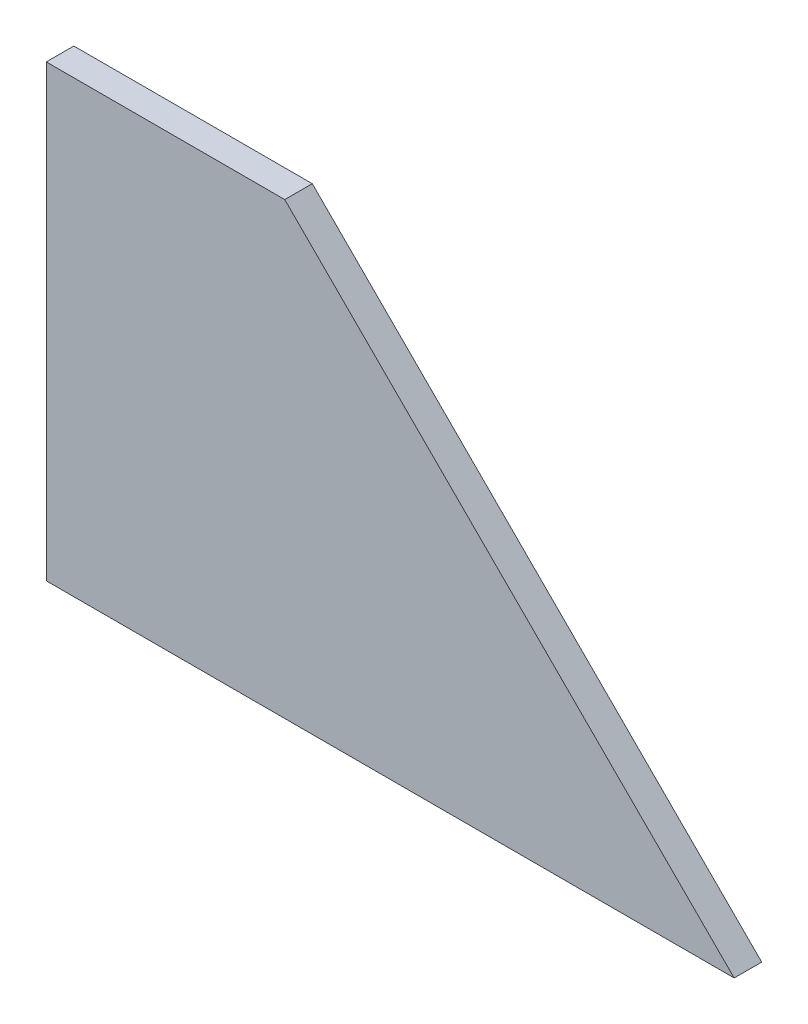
ISO-10303-21;
HEADER;
FILE_DESCRIPTION(('STEP AP214'),'2;1');
FILE_NAME('part.step','',(''),(''),'','','');
FILE_SCHEMA(('AUTOMOTIVE_DESIGN { 1 0 10303 214 1 1 1 1 }'));
ENDSEC;
DATA;
#1=APPLICATION_CONTEXT('core data for automotive mechanical design processes');
#2=APPLICATION_PROTOCOL_DEFINITION('international standard','automotive_design',2000,#1);
#3=PRODUCT_CONTEXT('',#1,'mechanical');
#4=PRODUCT('Part','Part','',(#3));
#5=PRODUCT_RELATED_PRODUCT_CATEGORY('part','',(#4));
#6=PRODUCT_DEFINITION_FORMATION('','',#4);
#7=PRODUCT_DEFINITION_CONTEXT('part definition',#1,'design');
#8=PRODUCT_DEFINITION('design','',#6,#7);
#9=PRODUCT_DEFINITION_SHAPE('','',#8);
#10=(LENGTH_UNIT() NAMED_UNIT(*) SI_UNIT(.MILLI.,.METRE.));
#11=(NAMED_UNIT(*) PLANE_ANGLE_UNIT() SI_UNIT($,.RADIAN.));
#12=(NAMED_UNIT(*) SI_UNIT($,.STERADIAN.) SOLID_ANGLE_UNIT());
#13=UNCERTAINTY_MEASURE_WITH_UNIT(LENGTH_MEASURE(1.E-05),#10,'distance_accuracy_value','');
#14=(GEOMETRIC_REPRESENTATION_CONTEXT(3) GLOBAL_UNCERTAINTY_ASSIGNED_CONTEXT((#13)) GLOBAL_UNIT_ASSIGNED_CONTEXT((#10,
#11,#12)) REPRESENTATION_CONTEXT('',''));
#15=CARTESIAN_POINT('',(0.,0.,0.));
#16=DIRECTION('',(0.,0.,1.));
#17=DIRECTION('',(1.,0.,0.));
#18=AXIS2_PLACEMENT_3D('',#15,#16,#17);
#19=CARTESIAN_POINT('',(0.,98.,-25.));
#20=DIRECTION('',(0.,-1.,0.));
#21=DIRECTION('',(0.,0.,-1.));
#22=AXIS2_PLACEMENT_3D('',#19,#20,#21);
#23=PLANE('',#22);
#24=DIRECTION('',(1.,0.,0.));
#25=VECTOR('',#24,1.);
#26=CARTESIAN_POINT('',(26.516504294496,98.,6.));
#27=LINE('',#26,#25);
#28=CARTESIAN_POINT('',(0.,98.,6.));
#29=VERTEX_POINT('',#28);
#30=CARTESIAN_POINT('',(52.,98.,6.));
#31=VERTEX_POINT('',#30);
#32=EDGE_CURVE('E10',#29,#31,#27,.T.);
#33=ORIENTED_EDGE('',*,*,#32,.T.);
#34=DIRECTION('',(0.,0.,1.));
#35=VECTOR('',#34,1.);
#36=CARTESIAN_POINT('',(52.,98.,-12.5));
#37=LINE('',#36,#35);
#38=CARTESIAN_POINT('',(52.,98.,0.));
#39=VERTEX_POINT('',#38);
#40=EDGE_CURVE('E78',#39,#31,#37,.T.);
#41=ORIENTED_EDGE('',*,*,#40,.F.);
#42=DIRECTION('',(1.,0.,0.));
#43=VECTOR('',#42,1.);
#44=CARTESIAN_POINT('',(26.516504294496,98.,0.));
#45=LINE('',#44,#43);
#46=CARTESIAN_POINT('',(0.,98.,0.));
#47=VERTEX_POINT('',#46);
#48=EDGE_CURVE('E24',#47,#39,#45,.T.);
#49=ORIENTED_EDGE('',*,*,#48,.F.);
#50=DIRECTION('',(0.,0.,1.));
#51=VECTOR('',#50,1.);
#52=CARTESIAN_POINT('',(0.,98.,-25.));
#53=LINE('',#52,#51);
#54=EDGE_CURVE('E75',#47,#29,#53,.T.);
#55=ORIENTED_EDGE('',*,*,#54,.T.);
#56=EDGE_LOOP('',(#33,#41,#49,#55));
#57=FACE_BOUND('',#56,.T.);
#58=ADVANCED_FACE('F16',(#57),#23,.F.);
#59=CARTESIAN_POINT('',(53.033008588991,53.033008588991,6.));
#60=DIRECTION('',(0.,0.,1.));
#61=DIRECTION('',(1.,0.,0.));
#62=AXIS2_PLACEMENT_3D('',#59,#60,#61);
#63=PLANE('',#62);
#64=ORIENTED_EDGE('',*,*,#32,.F.);
#65=DIRECTION('',(0.,-1.,0.));
#66=VECTOR('',#65,1.);
#67=CARTESIAN_POINT('',(0.,150.,6.));
#68=LINE('',#67,#66);
#69=CARTESIAN_POINT('',(0.,0.,6.));
#70=VERTEX_POINT('',#69);
#71=EDGE_CURVE('E88',#29,#70,#68,.T.);
#72=ORIENTED_EDGE('',*,*,#71,.T.);
#73=DIRECTION('',(1.,0.,0.));
#74=VECTOR('',#73,1.);
#75=CARTESIAN_POINT('',(0.,0.,6.));
#76=LINE('',#75,#74);
#77=CARTESIAN_POINT('',(150.,0.,6.));
#78=VERTEX_POINT('',#77);
#79=EDGE_CURVE('E86',#70,#78,#76,.T.);
#80=ORIENTED_EDGE('',*,*,#79,.T.);
#81=DIRECTION('',(-0.707106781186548,0.707106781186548,0.));
#82=VECTOR('',#81,1.);
#83=CARTESIAN_POINT('',(150.,0.,6.));
#84=LINE('',#83,#82);
#85=EDGE_CURVE('E101',#78,#31,#84,.T.);
#86=ORIENTED_EDGE('',*,*,#85,.T.);
#87=EDGE_LOOP('',(#64,#72,#80,#86));
#88=FACE_BOUND('',#87,.T.);
#89=ADVANCED_FACE('F116',(#88),#63,.T.);
#90=CARTESIAN_POINT('',(53.033008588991,53.033008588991,0.));
#91=DIRECTION('',(0.,0.,1.));
#92=DIRECTION('',(1.,0.,0.));
#93=AXIS2_PLACEMENT_3D('',#90,#91,#92);
#94=PLANE('',#93);
#95=DIRECTION('',(-0.707106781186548,0.707106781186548,0.));
#96=VECTOR('',#95,1.);
#97=CARTESIAN_POINT('',(150.,0.,0.));
#98=LINE('',#97,#96);
#99=CARTESIAN_POINT('',(150.,0.,0.));
#100=VERTEX_POINT('',#99);
#101=EDGE_CURVE('E91',#100,#39,#98,.T.);
#102=ORIENTED_EDGE('',*,*,#101,.F.);
#103=DIRECTION('',(1.,0.,0.));
#104=VECTOR('',#103,1.);
#105=CARTESIAN_POINT('',(0.,0.,0.));
#106=LINE('',#105,#104);
#107=CARTESIAN_POINT('',(0.,0.,0.));
#108=VERTEX_POINT('',#107);
#109=EDGE_CURVE('E84',#108,#100,#106,.T.);
#110=ORIENTED_EDGE('',*,*,#109,.F.);
#111=DIRECTION('',(0.,-1.,0.));
#112=VECTOR('',#111,1.);
#113=CARTESIAN_POINT('',(0.,150.,0.));
#114=LINE('',#113,#112);
#115=EDGE_CURVE('E69',#47,#108,#114,.T.);
#116=ORIENTED_EDGE('',*,*,#115,.F.);
#117=ORIENTED_EDGE('',*,*,#48,.T.);
#118=EDGE_LOOP('',(#102,#110,#116,#117));
#119=FACE_BOUND('',#118,.T.);
#120=ADVANCED_FACE('F90',(#119),#94,.F.);
#121=CARTESIAN_POINT('',(150.,0.,0.));
#122=DIRECTION('',(-0.707106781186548,-0.707106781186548,0.));
#123=DIRECTION('',(-0.707106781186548,0.707106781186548,0.));
#124=AXIS2_PLACEMENT_3D('',#121,#122,#123);
#125=PLANE('',#124);
#126=ORIENTED_EDGE('',*,*,#40,.T.);
#127=ORIENTED_EDGE('',*,*,#85,.F.);
#128=DIRECTION('',(0.,0.,1.));
#129=VECTOR('',#128,1.);
#130=CARTESIAN_POINT('',(150.,0.,0.));
#131=LINE('',#130,#129);
#132=EDGE_CURVE('E94',#100,#78,#131,.T.);
#133=ORIENTED_EDGE('',*,*,#132,.F.);
#134=ORIENTED_EDGE('',*,*,#101,.T.);
#135=EDGE_LOOP('',(#126,#127,#133,#134));
#136=FACE_BOUND('',#135,.T.);
#137=ADVANCED_FACE('F118',(#136),#125,.F.);
#138=CARTESIAN_POINT('',(0.,150.,0.));
#139=DIRECTION('',(1.,0.,0.));
#140=DIRECTION('',(0.,1.,0.));
#141=AXIS2_PLACEMENT_3D('',#138,#139,#140);
#142=PLANE('',#141);
#143=DIRECTION('',(0.,0.,1.));
#144=VECTOR('',#143,1.);
#145=CARTESIAN_POINT('',(0.,0.,0.));
#146=LINE('',#145,#144);
#147=EDGE_CURVE('E73',#108,#70,#146,.T.);
#148=ORIENTED_EDGE('',*,*,#147,.T.);
#149=ORIENTED_EDGE('',*,*,#71,.F.);
#150=ORIENTED_EDGE('',*,*,#54,.F.);
#151=ORIENTED_EDGE('',*,*,#115,.T.);
#152=EDGE_LOOP('',(#148,#149,#150,#151));
#153=FACE_BOUND('',#152,.T.);
#154=ADVANCED_FACE('F71',(#153),#142,.F.);
#155=CARTESIAN_POINT('',(0.,0.,0.));
#156=DIRECTION('',(0.,1.,0.));
#157=DIRECTION('',(1.,0.,0.));
#158=AXIS2_PLACEMENT_3D('',#155,#156,#157);
#159=PLANE('',#158);
#160=ORIENTED_EDGE('',*,*,#109,.T.);
#161=ORIENTED_EDGE('',*,*,#132,.T.);
#162=ORIENTED_EDGE('',*,*,#79,.F.);
#163=ORIENTED_EDGE('',*,*,#147,.F.);
#164=EDGE_LOOP('',(#160,#161,#162,#163));
#165=FACE_BOUND('',#164,.T.);
#166=ADVANCED_FACE('F82',(#165),#159,.F.);
#167=CLOSED_SHELL('',(#58,#89,#120,#137,#154,#166));
#168=MANIFOLD_SOLID_BREP('B1',#167);
#169=ADVANCED_BREP_SHAPE_REPRESENTATION('',(#18,#168),#14);
#170=SHAPE_DEFINITION_REPRESENTATION(#9,#169);
ENDSEC;
END-ISO-10303-21;
